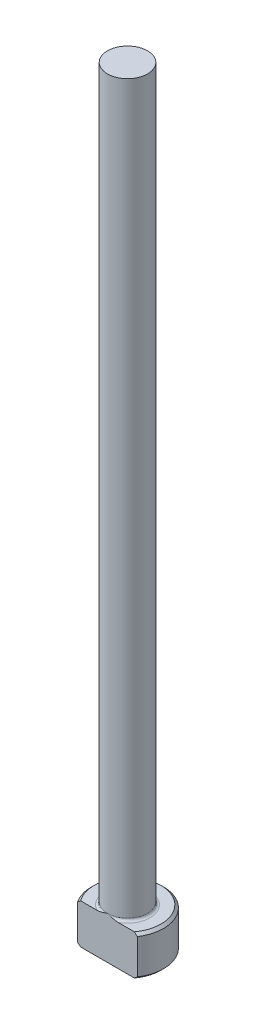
from build123d import *

# Parameters (mm, degrees)
CHAMFER1_SIZE = 0.254
FILLET1_R     = 0.254
KEY_DEPTH     = 77.366951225


with BuildPart() as part:
    # Sketch1 → Revolve1 (revolve)
    with BuildSketch(Plane.XY, mode=Mode.PRIVATE) as revolve1_sk:
        Polygon((0, 0), (-3.5687, 0), (-3.5687, 3.9624), (-1.98374, 3.9624), (-1.98374, 76.2), (0, 76.2), align=None)
    revolve(revolve1_sk.sketch.rotate(Axis((0, 259.958771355, 0), (0, -1, 0)), 270), axis=Axis((0, 259.958771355, 0), (0, -1, 0)))

    # Chamfer1
    chamfer1_edges = [part.edges().sort_by_distance(p)[0] for p in [
        (0, 3.9624, -3.5687),
        (0, 0, -3.5687),
    ]]
    chamfer(chamfer1_edges, length=CHAMFER1_SIZE)

    # Fillet1
    fillet1_edges = [part.edges().sort_by_distance(p)[0] for p in [
        (0, 3.9624, -1.98374),
    ]]
    fillet(fillet1_edges, radius=FILLET1_R)

    # Sketch2 → Key (cut, through all)
    with BuildSketch(Plane(origin=(0, 0, 0), x_dir=(1, 0, 0), z_dir=(0, 1, 0))):
        with BuildLine():
            Line((-2.966546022, -1.98374), (2.966546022, -1.98374))
            ThreePointArc((2.966546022, -1.98374), (0, -3.5687), (-2.966546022, -1.98374))
        make_face()
    extrude(amount=KEY_DEPTH, mode=Mode.SUBTRACT)


solid = part.part
